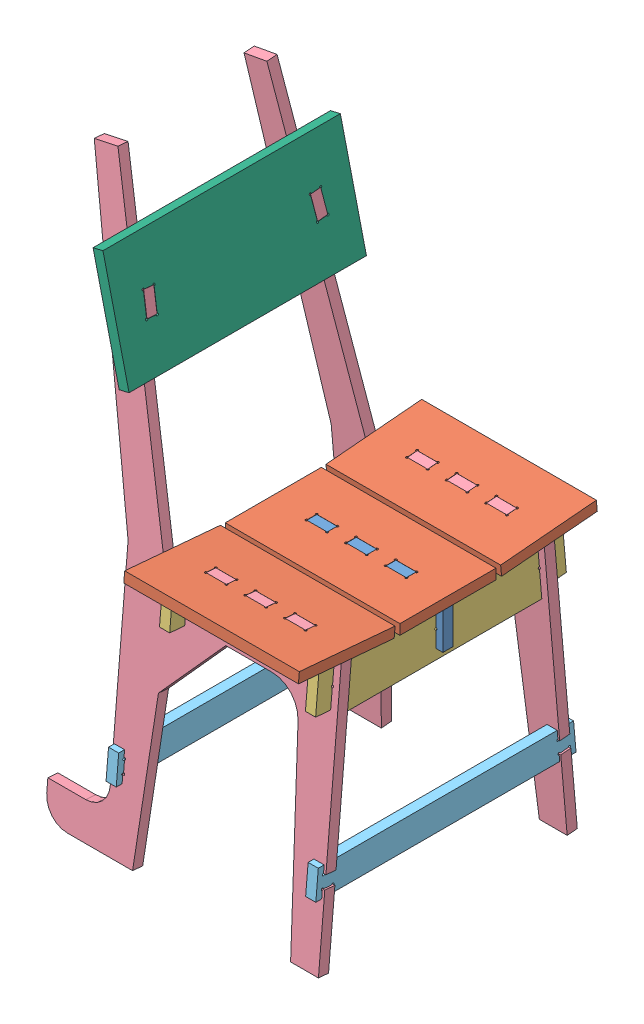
SolidWorks assembly FinalChair.SLDASM, configuration Default (file format 9000). Lengths in mm.
Overall size (484.32 1023.87 612.56).
15 component instances, 6 part files, 17 mates.
Components (placement in the parent):
- MidAssembly-1: MidAssembly.SLDASM [Default] at (-0.0899 9.2215 -0.1704) size (309 114.76 443.61)
  - MidSubAssembly-1: MidSubAssembly.SLDASM [Default] at (2.0055 -22.5545 3.9943) size (309 96.96 173.13)
    - CrossPlate-1: CrossPlate.SLDPRT [Default] at (89.3715 -56.9559 12.7448) size (300.91 82 18)
    - BottomPlate-1: BottomPlate.SLDPRT [Default] at (61.245 20.6985 162.1997) x (0 -0.087156 -0.996195) z (1 0 0) size (170.92 32.75 309)
  - FrontBeam-1: FrontBeam.SLDPRT [Default] at (91.8769 -79.5912 18.747) x (0 0 -1) z (1 0 0) size (443.61 92.96 18)
  - FrontBeam-2: FrontBeam.SLDPRT [Default] at (-166.3231 -79.5912 18.747) x (0 0 -1) z (1 0 0) size (443.61 92.96 18)
- SideSubAssly-1: SideSubAssly.SLDASM [Default] at (-175.5752 77.1857 -113.8851) x (-1 0 0) z (0 0.087156 -0.996195) size (484.12 1012.63 173.13)
  - LegBackSupport-1: LegBackSupport.SLDPRT [Default] at (-267.2622 -84.6057 77.4863) size (484.12 1012.63 18.5)
  - BottomPlate-1: BottomPlate.SLDPRT [Default] at (-238.5357 -65.8709 -105.4607) x (0 -0.087156 0.996195) z (-1 0 0) size (170.92 32.75 309)
- SideSubAssly-2: SideSubAssly.SLDASM [Default] at (-175.5752 84.5044 234.6914) x (-1 0 0) z (0 -0.087156 -0.996195) size (484.12 1012.63 173.13)
  - LegBackSupport-1: LegBackSupport.SLDPRT [Default] at (-267.2622 -84.6057 77.4863) size (484.12 1012.63 18.5)
  - BottomPlate-1: BottomPlate.SLDPRT [Default] at (-238.5357 -65.8709 -105.4607) x (0 -0.087156 0.996195) z (-1 0 0) size (170.92 32.75 309)
- BottomStiffner-1: BottomStiffner.sldprt [Default] at (100.9421 0.2913 -0.2255) x (0 0 -1) z (1 0 0) size (460.39 50 18)
- BottomStiffner-2: BottomStiffner.sldprt [Default] at (-252.1732 0.2913 -0.2255) x (0 0 -1) z (1 0 0) size (460.39 50 18)
- BackPlate-1: BackPlate.sldprt [Default] at (-176.8798 -42.1928 0) x (0 0 -1) z (0.973028 0.230687 0) size (420 200 18)
Mates (geometry in assembly coordinates):
- Width1: width aligned: plane of SideSubAssly-1/LegBackSupport-1 through (91.687 49.4232 -149.4254) normal (1 0 0); plane of SideSubAssly-1/LegBackSupport-1 through (109.887 -20.5513 -155.5473) normal (-1 0 0); plane of MidAssembly-1/FrontBeam-1 through (109.787 -70.3697 18.5766) normal (1 0 0); plane of MidAssembly-1/FrontBeam-1 through (91.787 -70.3697 18.5766) normal (-1 0 0)
- Width2: width aligned: plane of SideSubAssly-1/LegBackSupport-1 through (-322.181 -401.5682 -206.9517) normal (0 0.087156 -0.996195); plane of SideSubAssly-1/LegBackSupport-1 through (-322.181 -403.137 -189.0202) normal (0 -0.087156 0.996195); plane of MidAssembly-1/FrontBeam-1 through (109.787 -70.3697 -159.8065) normal (0 0.087156 -0.996195); plane of MidAssembly-1/FrontBeam-1 through (109.787 -18.9737 -173.5795) normal (0 -0.087156 0.996195)
- Coincident1: coincident anti-aligned: plane of MidAssembly-1/FrontBeam-1 through (109.787 -20.56 -155.4487) normal (0 -0.996195 -0.087156); plane of SideSubAssly-1/LegBackSupport-1 through (91.687 -20.5513 -155.5473) normal (0 0.996195 0.087156)
- Width3: width anti-aligned: plane of MidAssembly-1/FrontBeam-1 through (109.787 -70.3697 196.9597) normal (0 0.087156 0.996195); plane of MidAssembly-1/FrontBeam-1 through (109.787 -18.9737 210.7327) normal (0 -0.087156 -0.996195); plane of SideSubAssly-2/LegBackSupport-1 through (-322.181 -403.137 226.1734) normal (0 -0.087156 -0.996195); plane of SideSubAssly-2/LegBackSupport-1 through (-322.181 -401.5682 244.1049) normal (0 0.087156 0.996195)
- Width4: width anti-aligned: plane of SideSubAssly-2/LegBackSupport-1 through (91.687 50.9922 204.512) normal (1 0 0); plane of SideSubAssly-2/LegBackSupport-1 through (109.887 -18.9824 210.634) normal (-1 0 0); plane of MidAssembly-1/FrontBeam-1 through (91.787 -70.3697 18.5766) normal (-1 0 0); plane of MidAssembly-1/FrontBeam-1 through (109.787 -70.3697 18.5766) normal (1 0 0)
- Coincident2: coincident anti-aligned: plane of MidAssembly-1/FrontBeam-1 through (109.787 -20.56 192.6019) normal (0 -0.996195 0.087156); plane of SideSubAssly-2/LegBackSupport-1 through (91.687 -18.9824 210.634) normal (0 0.996195 -0.087156)
- Coincident7: coincident anti-aligned: plane of BackPlate-1 through (-176.8798 -42.1928 0) normal (-0.973028 -0.230687 0); plane of assembly through (-176.9377 -41.9487 0) normal (0.973028 0.230687 0)
- Parallel2: parallel: plane of SideSubAssly-1/LegBackSupport-1 through (-322.181 -403.137 -189.0202) normal (0 -0.087156 0.996195); line of BackPlate-1 through (-259.1789 382.9686 -119.9709) axis (0.229856 -0.969521 -0.084822)
- Parallel3: parallel: plane of SideSubAssly-2/LegBackSupport-1 through (-322.181 -403.137 226.1734) normal (0 -0.087156 -0.996195); line of BackPlate-1 through (-250.7891 347.5811 160.2201) axis (-0.229856 0.969521 -0.084822)
- Coincident10: coincident anti-aligned: plane of BackPlate-1; plane of assembly through (0 0 0) normal (0 0 1)
- Coincident11: coincident anti-aligned: plane of SideSubAssly-1/LegBackSupport-1 through (-277.1655 376.3908 -69.9488) normal (-0.229856 0.969521 0.084822); plane of BackPlate-1 through (-259.6386 384.9076 -119.8013) normal (0.229856 -0.969521 -0.084822)
- Width9: width anti-aligned: plane of SideSubAssly-1/LegBackSupport-1 through (100.9421 -291.5801 -178.9874) normal (0 -0.996195 -0.087156); plane of SideSubAssly-1/LegBackSupport-1 through (100.9421 -312.3821 -199.3781) normal (0 0.996195 0.087156); plane of BottomStiffner-1 through (118.9421 -290.193 -197.7096) normal (0 0.996195 0.087156); plane of BottomStiffner-1 through (118.9421 -312.1093 -199.627) normal (0 -0.996195 -0.087156)
- Coincident14: coincident: plane of SideSubAssly-1/LegBackSupport-1 through (-322.181 -403.137 -189.0202) normal (0 -0.087156 0.996195); line of BottomStiffner-1 through (118.9421 -276.193 -177.9141) axis (-1 0 0)
- Coincident15: coincident anti-aligned: plane of SideSubAssly-1/LegBackSupport-1 through (100.9421 -0.3446 -198.4505) normal (1 0 0); plane of BottomStiffner-1 through (100.9421 0.2913 -0.2255) normal (-1 0 0)
- Width11: width anti-aligned: plane of SideSubAssly-1/LegBackSupport-1 through (-234.1732 -289.9876 -197.1897) normal (0 -0.996195 -0.087156); plane of SideSubAssly-1/LegBackSupport-1 through (-234.1732 -313.9707 -181.2192) normal (0 0.996195 0.087156); plane of BottomStiffner-2 through (-234.1732 -290.193 -197.7096) normal (0 0.996195 0.087156); plane of BottomStiffner-2 through (-234.1732 -312.1093 -199.627) normal (0 -0.996195 -0.087156)
- Coincident16: coincident: plane of SideSubAssly-1/LegBackSupport-1 through (-322.181 -403.137 -189.0202) normal (0 -0.087156 0.996195); line of BottomStiffner-2 through (-234.1732 -276.193 -177.9141) axis (-1 0 0)
- Coincident17: coincident anti-aligned: plane of SideSubAssly-1/LegBackSupport-1 through (-234.1732 -0.3446 -198.4505) normal (-1 0 0); plane of BottomStiffner-2 through (-234.1732 0.2913 -0.2255) normal (1 0 0)
